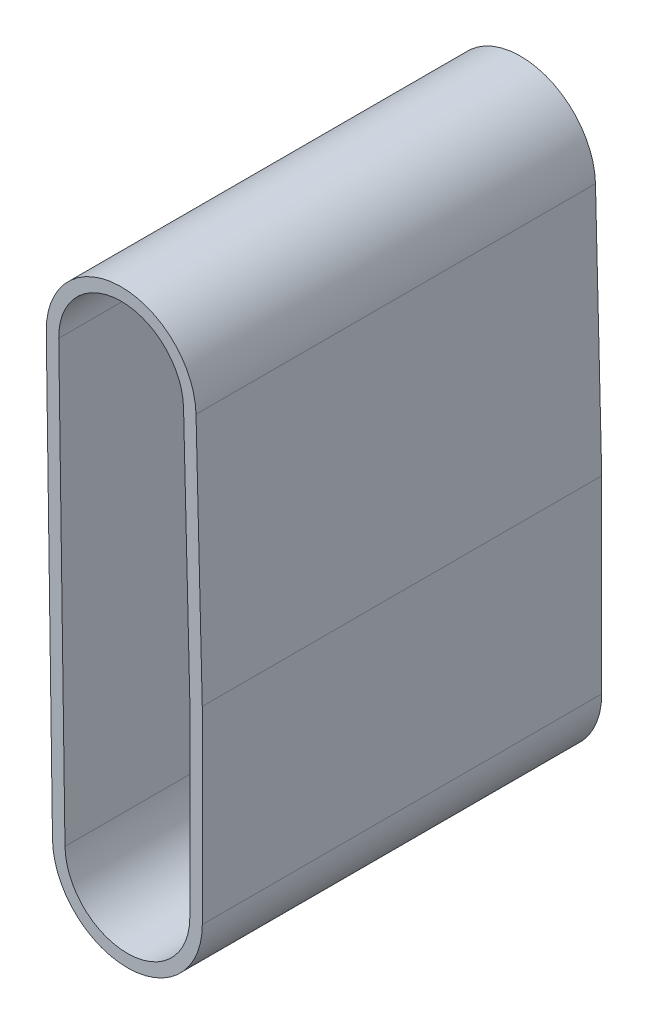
from build123d import *

# Parameters (mm, degrees)
AUFSATZ_LINEAR_AUSTRAGEN2_DEPTH      = 80
AUFSATZ_LINEAR_AUSTRAGEN2_DEPTH_BACK = 80


with BuildPart() as part:
    # Skizze3 → Aufsatz-Linear austragen2 (new, two sides: drawn at the far end of the back side and taken through both)
    with BuildSketch(Plane.XY.offset(-AUFSATZ_LINEAR_AUSTRAGEN2_DEPTH_BACK)):
        with BuildLine():
            Line((-32.496939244, 174.571472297), (-29.996939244, -0.428527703))
            ThreePointArc((-29.996939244, -0.428527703), (0.215818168, -29.999223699), (29.99999984, 0.003097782))
            Line((29.99999984, 0.003097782), (29.992184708, 75.687553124))
            Line((29.992184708, 75.687553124), (27.490629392, 175.749765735))
            ThreePointArc((27.490629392, 175.749765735), (-3.089155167, 204.994214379), (-32.496939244, 174.571472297))
        make_face()
        with BuildLine():
            Line((22.49219116, 175.624804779), (24.99219116, 75.624804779))
            Line((24.99219116, 75.624804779), (24.999999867, 0.002581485))
            ThreePointArc((24.999999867, 0.002581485), (0.179848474, -24.999353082), (-24.99744937, -0.35710642))
            Line((-24.99744937, -0.35710642), (-27.49744937, 174.64289358))
            ThreePointArc((-27.49744937, 174.64289358), (-2.990962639, 199.995178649), (22.49219116, 175.624804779))
        make_face(mode=Mode.SUBTRACT)
    extrude(amount=AUFSATZ_LINEAR_AUSTRAGEN2_DEPTH + AUFSATZ_LINEAR_AUSTRAGEN2_DEPTH_BACK)


solid = part.part
